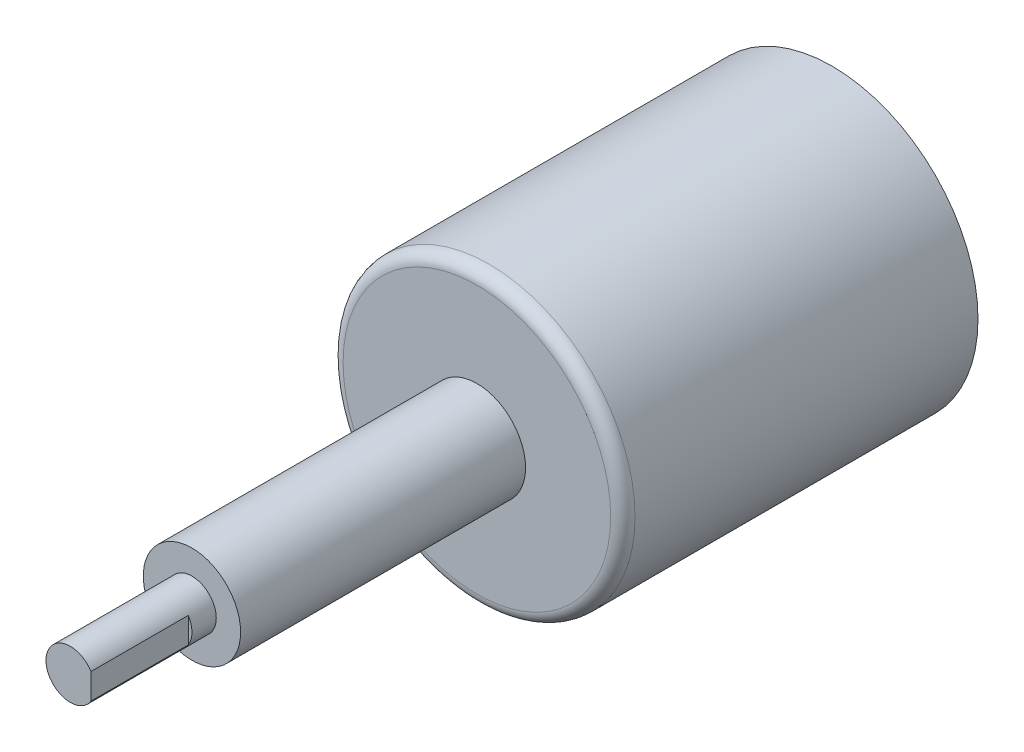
from build123d import *

# Parameters (mm, degrees)
ESQUISSE1_R             = 12
EXTRUSION1_DEPTH        = 29.2
CONG_1_R                = 1
ESQUISSE2_R             = 4
EXTRUSION2_DEPTH        = 23.43
ESQUISSE3_R             = 2
EXTRUSION3_DEPTH        = 10
ESQUISSE4_W             = 2.464985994
ESQUISSE4_H             = 8.179271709
ENL_V_MAT_EXTRU_1_DEPTH = 8


with BuildPart() as part:
    # Esquisse1 → Extrusion1 (new body)
    with BuildSketch(Plane.XY):
        Circle(ESQUISSE1_R)
    extrude(amount=EXTRUSION1_DEPTH)

    # Cong_1
    cong_1_edges = [part.edges().sort_by_distance(p)[0] for p in [
        (-12, 0, 29.2),
    ]]
    fillet(cong_1_edges, radius=CONG_1_R)

    # Esquisse2 → Extrusion2 (add)
    with BuildSketch(Plane.XY.offset(29.2)):
        Circle(ESQUISSE2_R)
    extrude(amount=EXTRUSION2_DEPTH)

    # Esquisse3 → Extrusion3 (add)
    with BuildSketch(Plane.XY.offset(52.63)):
        Circle(ESQUISSE3_R)
    extrude(amount=EXTRUSION3_DEPTH)

    # Esquisse4 → Enl_v. mat.-Extru.1 (cut)
    with BuildSketch(Plane.XY.offset(62.63)):
        with Locations((2.932492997, -0.280112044)):
            Rectangle(ESQUISSE4_W, ESQUISSE4_H)
    extrude(amount=-ENL_V_MAT_EXTRU_1_DEPTH, mode=Mode.SUBTRACT)


solid = part.part
